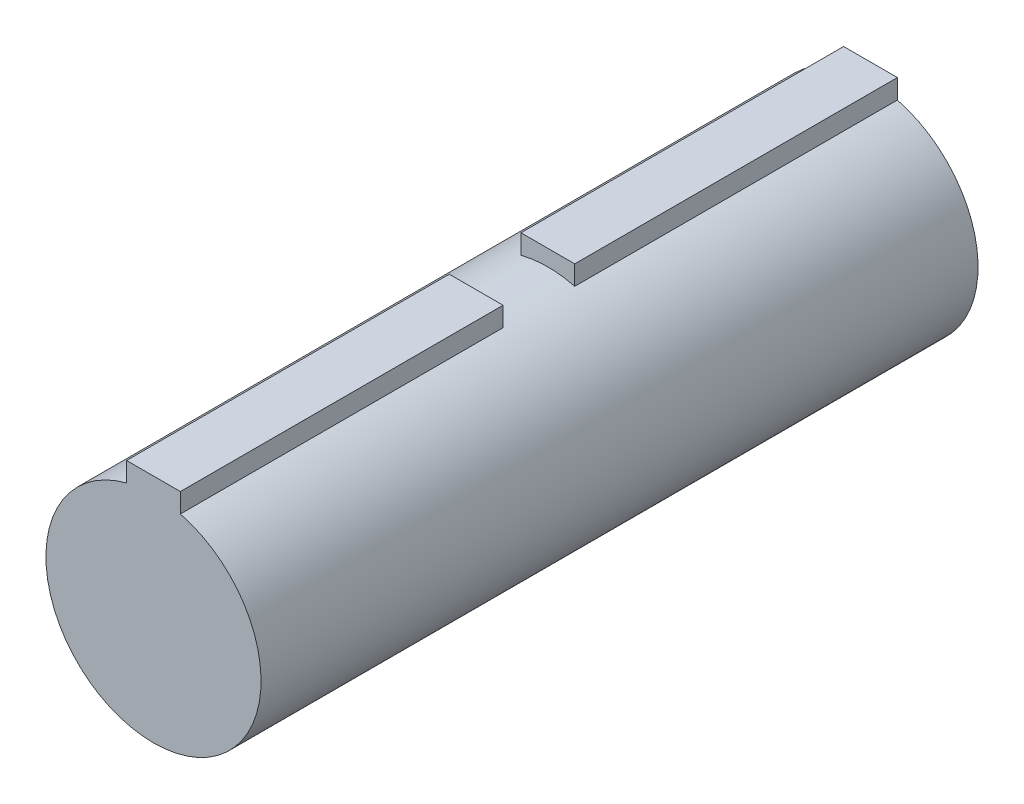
from build123d import *

# Parameters (mm, degrees)
BOSS_EXTRUDE1_DEPTH = 28.575
SKETCH2_R           = 9.525
BOSS_EXTRUDE2_DEPTH = 6.35
BOSS_EXTRUDE3_DEPTH = 28.575


with BuildPart() as part:
    # Sketch1 → Boss-Extrude1 (new body)
    with BuildSketch(Plane.XY):
        with BuildLine():
            Line((-2.38125, 10.947399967), (2.38125, 10.947399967))
            Line((2.38125, 10.947399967), (2.38125, 9.222541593))
            ThreePointArc((2.38125, 9.222541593), (0, -9.525), (-2.38125, 9.222541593))
            Line((-2.38125, 9.222541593), (-2.38125, 10.947399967))
        make_face()
    extrude(amount=BOSS_EXTRUDE1_DEPTH)

    # Sketch2 → Boss-Extrude2 (add)
    with BuildSketch(Plane.XY.offset(28.575)):
        with Locations(Location((0, 0, 0), (0, 0, 104.477512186))):
            Circle(SKETCH2_R)
    extrude(amount=BOSS_EXTRUDE2_DEPTH)

    # Sketch3 → Boss-Extrude3 (add)
    with BuildSketch(Plane.XY.offset(34.925)):
        with BuildLine():
            Line((-2.38125, 10.947399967), (2.38125, 10.947399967))
            Line((2.38125, 10.947399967), (2.38125, 9.222541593))
            ThreePointArc((2.38125, 9.222541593), (0, -9.525), (-2.38125, 9.222541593))
            Line((-2.38125, 9.222541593), (-2.38125, 10.947399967))
        make_face()
    extrude(amount=BOSS_EXTRUDE3_DEPTH)


solid = part.part
